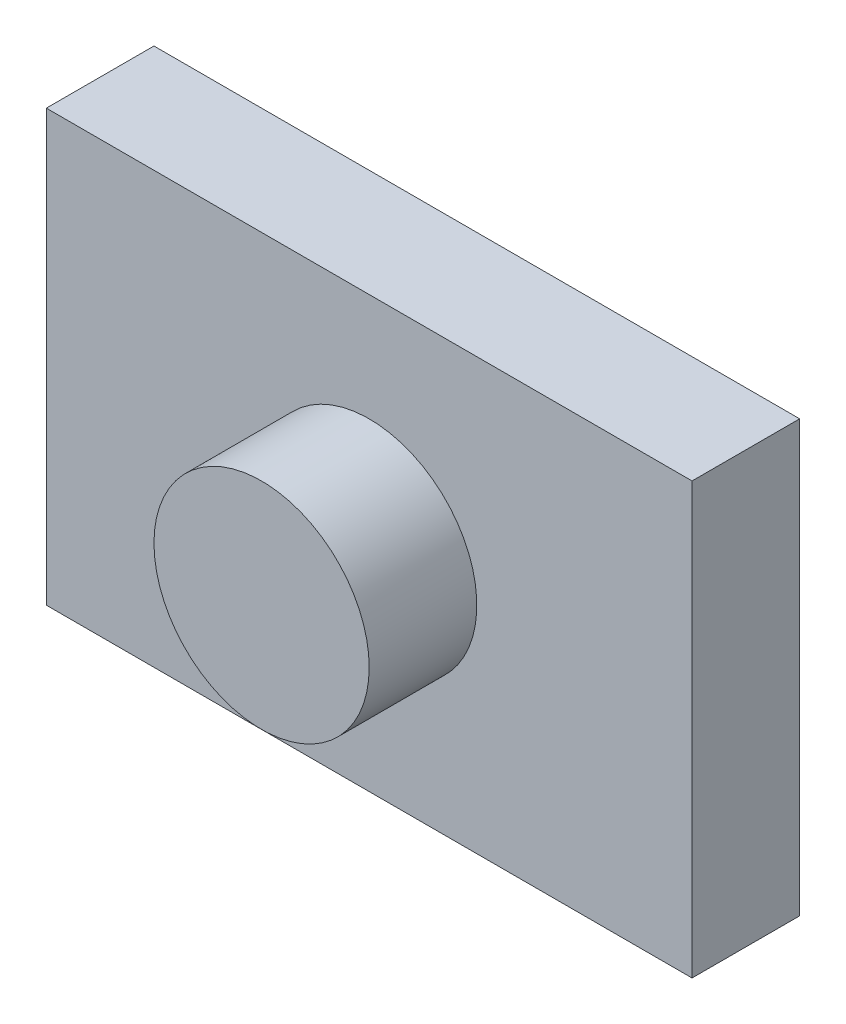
from build123d import *

# Parameters (mm, degrees)
SKETCH2_W           = 60
SKETCH2_H           = 40
EXTRUDE1_DEPTH      = 5
EXTRUDE2_DEPTH      = 10
EXTRUDE2_DEPTH_BACK = 20
SKETCH3_R           = 10


with BuildPart() as part:
    # Sketch2 → Extrude1 (new, symmetric)
    with BuildSketch(Plane.XY):
        with Locations((30, 20)):
            Rectangle(SKETCH2_W, SKETCH2_H)
    extrude(amount=EXTRUDE1_DEPTH, both=True)

    # Sketch3 → Extrude2 (add, two sides: drawn at the far end of the back side and taken through both)
    with BuildSketch(Plane.XY.offset(5).offset(-EXTRUDE2_DEPTH_BACK)):
        with Locations(Location((30, 20, 0), (0, 0, 180))):
            Circle(SKETCH3_R)
    extrude(amount=EXTRUDE2_DEPTH + EXTRUDE2_DEPTH_BACK)


solid = part.part
